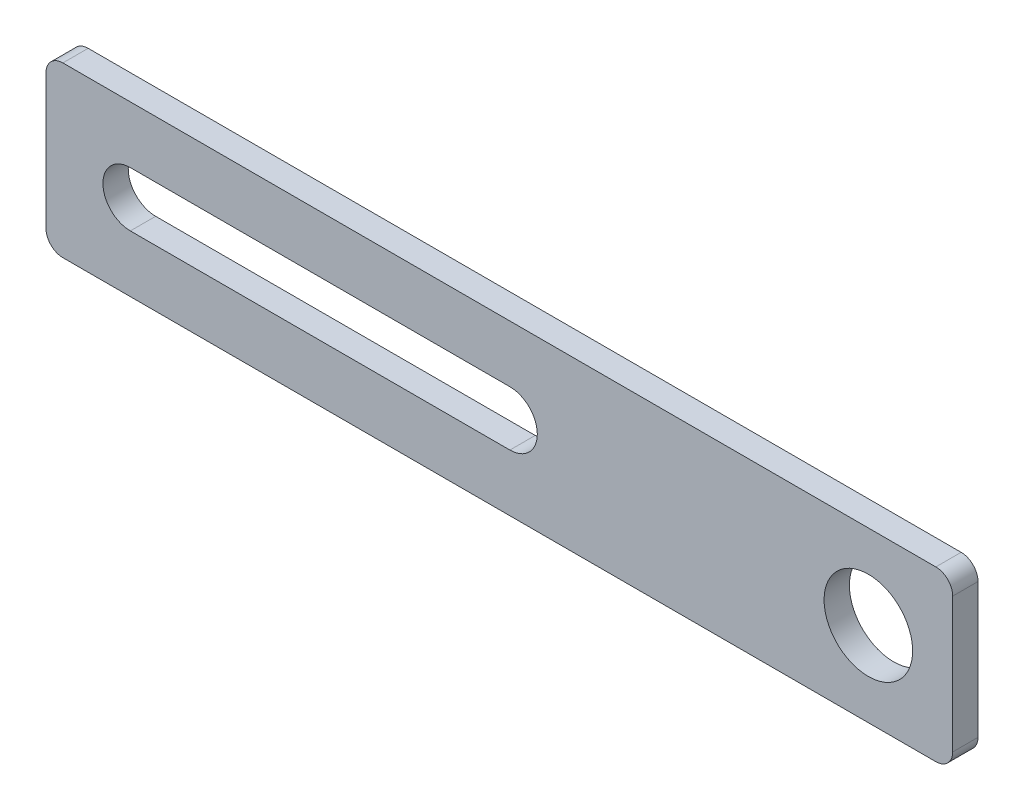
ISO-10303-21;
HEADER;
FILE_DESCRIPTION(('STEP AP214'),'2;1');
FILE_NAME('part.step','',(''),(''),'','','');
FILE_SCHEMA(('AUTOMOTIVE_DESIGN { 1 0 10303 214 1 1 1 1 }'));
ENDSEC;
DATA;
#1=APPLICATION_CONTEXT('core data for automotive mechanical design processes');
#2=APPLICATION_PROTOCOL_DEFINITION('international standard','automotive_design',2000,#1);
#3=PRODUCT_CONTEXT('',#1,'mechanical');
#4=PRODUCT('Part','Part','',(#3));
#5=PRODUCT_RELATED_PRODUCT_CATEGORY('part','',(#4));
#6=PRODUCT_DEFINITION_FORMATION('','',#4);
#7=PRODUCT_DEFINITION_CONTEXT('part definition',#1,'design');
#8=PRODUCT_DEFINITION('design','',#6,#7);
#9=PRODUCT_DEFINITION_SHAPE('','',#8);
#10=(LENGTH_UNIT() NAMED_UNIT(*) SI_UNIT(.MILLI.,.METRE.));
#11=(NAMED_UNIT(*) PLANE_ANGLE_UNIT() SI_UNIT($,.RADIAN.));
#12=(NAMED_UNIT(*) SI_UNIT($,.STERADIAN.) SOLID_ANGLE_UNIT());
#13=UNCERTAINTY_MEASURE_WITH_UNIT(LENGTH_MEASURE(1.E-05),#10,'distance_accuracy_value','');
#14=(GEOMETRIC_REPRESENTATION_CONTEXT(3) GLOBAL_UNCERTAINTY_ASSIGNED_CONTEXT((#13)) GLOBAL_UNIT_ASSIGNED_CONTEXT((#10,
#11,#12)) REPRESENTATION_CONTEXT('',''));
#15=CARTESIAN_POINT('',(0.,0.,0.));
#16=DIRECTION('',(0.,0.,1.));
#17=DIRECTION('',(1.,0.,0.));
#18=AXIS2_PLACEMENT_3D('',#15,#16,#17);
#19=CARTESIAN_POINT('',(105.,-20.,6.));
#20=DIRECTION('',(0.,0.,-1.));
#21=DIRECTION('',(0.,-1.,0.));
#22=AXIS2_PLACEMENT_3D('',#19,#20,#21);
#23=PLANE('',#22);
#24=DIRECTION('',(-1.,0.,0.));
#25=VECTOR('',#24,1.);
#26=CARTESIAN_POINT('',(105.,-20.,6.));
#27=LINE('',#26,#25);
#28=CARTESIAN_POINT('',(101.,-20.,6.));
#29=VERTEX_POINT('',#28);
#30=CARTESIAN_POINT('',(-106.,-20.,6.));
#31=VERTEX_POINT('',#30);
#32=EDGE_CURVE('E157',#29,#31,#27,.T.);
#33=ORIENTED_EDGE('',*,*,#32,.F.);
#34=CARTESIAN_POINT('',(101.,-16.,6.));
#35=DIRECTION('',(0.,0.,-1.));
#36=DIRECTION('',(0.,-1.,0.));
#37=AXIS2_PLACEMENT_3D('',#34,#35,#36);
#38=CIRCLE('',#37,4.);
#39=CARTESIAN_POINT('',(105.,-16.,6.));
#40=VERTEX_POINT('',#39);
#41=EDGE_CURVE('E194',#29,#40,#38,.F.);
#42=ORIENTED_EDGE('',*,*,#41,.T.);
#43=DIRECTION('',(0.,1.,0.));
#44=VECTOR('',#43,1.);
#45=CARTESIAN_POINT('',(105.,-20.,6.));
#46=LINE('',#45,#44);
#47=CARTESIAN_POINT('',(105.,16.,6.));
#48=VERTEX_POINT('',#47);
#49=EDGE_CURVE('E169',#40,#48,#46,.T.);
#50=ORIENTED_EDGE('',*,*,#49,.T.);
#51=CARTESIAN_POINT('',(101.,16.,6.));
#52=DIRECTION('',(0.,0.,-1.));
#53=DIRECTION('',(0.,-1.,0.));
#54=AXIS2_PLACEMENT_3D('',#51,#52,#53);
#55=CIRCLE('',#54,4.);
#56=CARTESIAN_POINT('',(101.,20.,6.));
#57=VERTEX_POINT('',#56);
#58=EDGE_CURVE('E33',#48,#57,#55,.F.);
#59=ORIENTED_EDGE('',*,*,#58,.T.);
#60=DIRECTION('',(-1.,0.,0.));
#61=VECTOR('',#60,1.);
#62=CARTESIAN_POINT('',(105.,20.,6.));
#63=LINE('',#62,#61);
#64=CARTESIAN_POINT('',(-106.,20.,6.));
#65=VERTEX_POINT('',#64);
#66=EDGE_CURVE('E152',#57,#65,#63,.T.);
#67=ORIENTED_EDGE('',*,*,#66,.T.);
#68=CARTESIAN_POINT('',(-106.,16.,6.));
#69=DIRECTION('',(0.,0.,-1.));
#70=DIRECTION('',(0.,-1.,0.));
#71=AXIS2_PLACEMENT_3D('',#68,#69,#70);
#72=CIRCLE('',#71,4.);
#73=CARTESIAN_POINT('',(-110.,16.,6.));
#74=VERTEX_POINT('',#73);
#75=EDGE_CURVE('E190',#65,#74,#72,.F.);
#76=ORIENTED_EDGE('',*,*,#75,.T.);
#77=DIRECTION('',(0.,1.,0.));
#78=VECTOR('',#77,1.);
#79=CARTESIAN_POINT('',(-110.,-20.,6.));
#80=LINE('',#79,#78);
#81=CARTESIAN_POINT('',(-110.,-16.,6.));
#82=VERTEX_POINT('',#81);
#83=EDGE_CURVE('E166',#82,#74,#80,.T.);
#84=ORIENTED_EDGE('',*,*,#83,.F.);
#85=CARTESIAN_POINT('',(-106.,-16.,6.));
#86=DIRECTION('',(0.,0.,-1.));
#87=DIRECTION('',(0.,-1.,0.));
#88=AXIS2_PLACEMENT_3D('',#85,#86,#87);
#89=CIRCLE('',#88,4.);
#90=EDGE_CURVE('E192',#82,#31,#89,.F.);
#91=ORIENTED_EDGE('',*,*,#90,.T.);
#92=EDGE_LOOP('',(#33,#42,#50,#59,#67,#76,#84,#91));
#93=FACE_BOUND('',#92,.T.);
#94=CARTESIAN_POINT('',(85.,0.,6.));
#95=DIRECTION('',(0.,0.,-1.));
#96=DIRECTION('',(0.,-1.,0.));
#97=AXIS2_PLACEMENT_3D('',#94,#95,#96);
#98=CIRCLE('',#97,10.5);
#99=CARTESIAN_POINT('',(85.,-10.5,6.));
#100=VERTEX_POINT('',#99);
#101=EDGE_CURVE('E147',#100,#100,#98,.T.);
#102=ORIENTED_EDGE('',*,*,#101,.T.);
#103=EDGE_LOOP('',(#102));
#104=FACE_BOUND('',#103,.T.);
#105=CARTESIAN_POINT('',(-90.,0.,6.));
#106=DIRECTION('',(0.,0.,1.));
#107=DIRECTION('',(0.,1.,0.));
#108=AXIS2_PLACEMENT_3D('',#105,#106,#107);
#109=CIRCLE('',#108,6.5);
#110=CARTESIAN_POINT('',(-90.,6.5,6.));
#111=VERTEX_POINT('',#110);
#112=CARTESIAN_POINT('',(-90.,-6.5,6.));
#113=VERTEX_POINT('',#112);
#114=EDGE_CURVE('E108',#111,#113,#109,.T.);
#115=ORIENTED_EDGE('',*,*,#114,.F.);
#116=DIRECTION('',(1.,0.,0.));
#117=VECTOR('',#116,1.);
#118=CARTESIAN_POINT('',(-90.,6.5,6.));
#119=LINE('',#118,#117);
#120=CARTESIAN_POINT('',(0.,6.5,6.));
#121=VERTEX_POINT('',#120);
#122=EDGE_CURVE('E137',#111,#121,#119,.T.);
#123=ORIENTED_EDGE('',*,*,#122,.T.);
#124=CARTESIAN_POINT('',(0.,0.,6.));
#125=DIRECTION('',(0.,0.,-1.));
#126=DIRECTION('',(0.,-1.,0.));
#127=AXIS2_PLACEMENT_3D('',#124,#125,#126);
#128=CIRCLE('',#127,6.5);
#129=CARTESIAN_POINT('',(0.,-6.5,6.));
#130=VERTEX_POINT('',#129);
#131=EDGE_CURVE('E134',#121,#130,#128,.T.);
#132=ORIENTED_EDGE('',*,*,#131,.T.);
#133=DIRECTION('',(1.,0.,0.));
#134=VECTOR('',#133,1.);
#135=CARTESIAN_POINT('',(-90.,-6.5,6.));
#136=LINE('',#135,#134);
#137=EDGE_CURVE('E132',#113,#130,#136,.T.);
#138=ORIENTED_EDGE('',*,*,#137,.F.);
#139=EDGE_LOOP('',(#115,#123,#132,#138));
#140=FACE_BOUND('',#139,.T.);
#141=ADVANCED_FACE('F14',(#93,#104,#140),#23,.F.);
#142=CARTESIAN_POINT('',(105.,-20.,0.));
#143=DIRECTION('',(0.,0.,-1.));
#144=DIRECTION('',(0.,-1.,0.));
#145=AXIS2_PLACEMENT_3D('',#142,#143,#144);
#146=PLANE('',#145);
#147=DIRECTION('',(0.,1.,0.));
#148=VECTOR('',#147,1.);
#149=CARTESIAN_POINT('',(105.,-20.,0.));
#150=LINE('',#149,#148);
#151=CARTESIAN_POINT('',(105.,-16.,0.));
#152=VERTEX_POINT('',#151);
#153=CARTESIAN_POINT('',(105.,16.,0.));
#154=VERTEX_POINT('',#153);
#155=EDGE_CURVE('E160',#152,#154,#150,.T.);
#156=ORIENTED_EDGE('',*,*,#155,.F.);
#157=CARTESIAN_POINT('',(101.,-16.,0.));
#158=DIRECTION('',(0.,0.,-1.));
#159=DIRECTION('',(0.,-1.,0.));
#160=AXIS2_PLACEMENT_3D('',#157,#158,#159);
#161=CIRCLE('',#160,4.);
#162=CARTESIAN_POINT('',(101.,-20.,0.));
#163=VERTEX_POINT('',#162);
#164=EDGE_CURVE('E182',#152,#163,#161,.T.);
#165=ORIENTED_EDGE('',*,*,#164,.T.);
#166=DIRECTION('',(-1.,0.,0.));
#167=VECTOR('',#166,1.);
#168=CARTESIAN_POINT('',(105.,-20.,0.));
#169=LINE('',#168,#167);
#170=CARTESIAN_POINT('',(-106.,-20.,0.));
#171=VERTEX_POINT('',#170);
#172=EDGE_CURVE('E154',#163,#171,#169,.T.);
#173=ORIENTED_EDGE('',*,*,#172,.T.);
#174=CARTESIAN_POINT('',(-106.,-16.,0.));
#175=DIRECTION('',(0.,0.,-1.));
#176=DIRECTION('',(0.,-1.,0.));
#177=AXIS2_PLACEMENT_3D('',#174,#175,#176);
#178=CIRCLE('',#177,4.);
#179=CARTESIAN_POINT('',(-110.,-16.,0.));
#180=VERTEX_POINT('',#179);
#181=EDGE_CURVE('E180',#171,#180,#178,.T.);
#182=ORIENTED_EDGE('',*,*,#181,.T.);
#183=DIRECTION('',(0.,1.,0.));
#184=VECTOR('',#183,1.);
#185=CARTESIAN_POINT('',(-110.,-20.,0.));
#186=LINE('',#185,#184);
#187=CARTESIAN_POINT('',(-110.,16.,0.));
#188=VERTEX_POINT('',#187);
#189=EDGE_CURVE('E163',#180,#188,#186,.T.);
#190=ORIENTED_EDGE('',*,*,#189,.T.);
#191=CARTESIAN_POINT('',(-106.,16.,0.));
#192=DIRECTION('',(0.,0.,-1.));
#193=DIRECTION('',(0.,-1.,0.));
#194=AXIS2_PLACEMENT_3D('',#191,#192,#193);
#195=CIRCLE('',#194,4.);
#196=CARTESIAN_POINT('',(-106.,20.,0.));
#197=VERTEX_POINT('',#196);
#198=EDGE_CURVE('E178',#188,#197,#195,.T.);
#199=ORIENTED_EDGE('',*,*,#198,.T.);
#200=DIRECTION('',(-1.,0.,0.));
#201=VECTOR('',#200,1.);
#202=CARTESIAN_POINT('',(105.,20.,0.));
#203=LINE('',#202,#201);
#204=CARTESIAN_POINT('',(101.,20.,0.));
#205=VERTEX_POINT('',#204);
#206=EDGE_CURVE('E150',#205,#197,#203,.T.);
#207=ORIENTED_EDGE('',*,*,#206,.F.);
#208=CARTESIAN_POINT('',(101.,16.,0.));
#209=DIRECTION('',(0.,0.,-1.));
#210=DIRECTION('',(0.,-1.,0.));
#211=AXIS2_PLACEMENT_3D('',#208,#209,#210);
#212=CIRCLE('',#211,4.);
#213=EDGE_CURVE('E176',#205,#154,#212,.T.);
#214=ORIENTED_EDGE('',*,*,#213,.T.);
#215=EDGE_LOOP('',(#156,#165,#173,#182,#190,#199,#207,#214));
#216=FACE_BOUND('',#215,.T.);
#217=CARTESIAN_POINT('',(85.,0.,0.));
#218=DIRECTION('',(0.,0.,-1.));
#219=DIRECTION('',(0.,-1.,0.));
#220=AXIS2_PLACEMENT_3D('',#217,#218,#219);
#221=CIRCLE('',#220,10.5);
#222=CARTESIAN_POINT('',(85.,-10.5,0.));
#223=VERTEX_POINT('',#222);
#224=EDGE_CURVE('E112',#223,#223,#221,.T.);
#225=ORIENTED_EDGE('',*,*,#224,.F.);
#226=EDGE_LOOP('',(#225));
#227=FACE_BOUND('',#226,.T.);
#228=DIRECTION('',(1.,0.,0.));
#229=VECTOR('',#228,1.);
#230=CARTESIAN_POINT('',(-90.,6.5,0.));
#231=LINE('',#230,#229);
#232=CARTESIAN_POINT('',(-90.,6.5,0.));
#233=VERTEX_POINT('',#232);
#234=CARTESIAN_POINT('',(0.,6.5,0.));
#235=VERTEX_POINT('',#234);
#236=EDGE_CURVE('E126',#233,#235,#231,.T.);
#237=ORIENTED_EDGE('',*,*,#236,.F.);
#238=CARTESIAN_POINT('',(-90.,0.,0.));
#239=DIRECTION('',(0.,0.,1.));
#240=DIRECTION('',(0.,1.,0.));
#241=AXIS2_PLACEMENT_3D('',#238,#239,#240);
#242=CIRCLE('',#241,6.5);
#243=CARTESIAN_POINT('',(-90.,-6.5,0.));
#244=VERTEX_POINT('',#243);
#245=EDGE_CURVE('E105',#233,#244,#242,.T.);
#246=ORIENTED_EDGE('',*,*,#245,.T.);
#247=DIRECTION('',(1.,0.,0.));
#248=VECTOR('',#247,1.);
#249=CARTESIAN_POINT('',(-90.,-6.5,0.));
#250=LINE('',#249,#248);
#251=CARTESIAN_POINT('',(0.,-6.5,0.));
#252=VERTEX_POINT('',#251);
#253=EDGE_CURVE('E116',#244,#252,#250,.T.);
#254=ORIENTED_EDGE('',*,*,#253,.T.);
#255=CARTESIAN_POINT('',(0.,0.,0.));
#256=DIRECTION('',(0.,0.,-1.));
#257=DIRECTION('',(0.,-1.,0.));
#258=AXIS2_PLACEMENT_3D('',#255,#256,#257);
#259=CIRCLE('',#258,6.5);
#260=EDGE_CURVE('E121',#235,#252,#259,.T.);
#261=ORIENTED_EDGE('',*,*,#260,.F.);
#262=EDGE_LOOP('',(#237,#246,#254,#261));
#263=FACE_BOUND('',#262,.T.);
#264=ADVANCED_FACE('F124',(#216,#227,#263),#146,.T.);
#265=CARTESIAN_POINT('',(105.,-20.,6.));
#266=DIRECTION('',(1.,0.,0.));
#267=DIRECTION('',(0.,-1.,0.));
#268=AXIS2_PLACEMENT_3D('',#265,#266,#267);
#269=PLANE('',#268);
#270=ORIENTED_EDGE('',*,*,#49,.F.);
#271=DIRECTION('',(0.,0.,-1.));
#272=VECTOR('',#271,1.);
#273=CARTESIAN_POINT('',(105.,-16.,6.));
#274=LINE('',#273,#272);
#275=EDGE_CURVE('E173',#40,#152,#274,.T.);
#276=ORIENTED_EDGE('',*,*,#275,.T.);
#277=ORIENTED_EDGE('',*,*,#155,.T.);
#278=DIRECTION('',(0.,0.,-1.));
#279=VECTOR('',#278,1.);
#280=CARTESIAN_POINT('',(105.,16.,6.));
#281=LINE('',#280,#279);
#282=EDGE_CURVE('E171',#154,#48,#281,.F.);
#283=ORIENTED_EDGE('',*,*,#282,.T.);
#284=EDGE_LOOP('',(#270,#276,#277,#283));
#285=FACE_BOUND('',#284,.T.);
#286=ADVANCED_FACE('F233',(#285),#269,.T.);
#287=CARTESIAN_POINT('',(-110.,-20.,6.));
#288=DIRECTION('',(1.,0.,0.));
#289=DIRECTION('',(0.,-1.,0.));
#290=AXIS2_PLACEMENT_3D('',#287,#288,#289);
#291=PLANE('',#290);
#292=ORIENTED_EDGE('',*,*,#189,.F.);
#293=DIRECTION('',(0.,0.,-1.));
#294=VECTOR('',#293,1.);
#295=CARTESIAN_POINT('',(-110.,-16.,6.));
#296=LINE('',#295,#294);
#297=EDGE_CURVE('E199',#180,#82,#296,.F.);
#298=ORIENTED_EDGE('',*,*,#297,.T.);
#299=ORIENTED_EDGE('',*,*,#83,.T.);
#300=DIRECTION('',(0.,0.,-1.));
#301=VECTOR('',#300,1.);
#302=CARTESIAN_POINT('',(-110.,16.,6.));
#303=LINE('',#302,#301);
#304=EDGE_CURVE('E196',#74,#188,#303,.T.);
#305=ORIENTED_EDGE('',*,*,#304,.T.);
#306=EDGE_LOOP('',(#292,#298,#299,#305));
#307=FACE_BOUND('',#306,.T.);
#308=ADVANCED_FACE('F214',(#307),#291,.F.);
#309=CARTESIAN_POINT('',(105.,-20.,0.));
#310=DIRECTION('',(0.,1.,0.));
#311=DIRECTION('',(1.,0.,0.));
#312=AXIS2_PLACEMENT_3D('',#309,#310,#311);
#313=PLANE('',#312);
#314=ORIENTED_EDGE('',*,*,#172,.F.);
#315=DIRECTION('',(0.,0.,-1.));
#316=VECTOR('',#315,1.);
#317=CARTESIAN_POINT('',(101.,-20.,6.));
#318=LINE('',#317,#316);
#319=EDGE_CURVE('E187',#163,#29,#318,.F.);
#320=ORIENTED_EDGE('',*,*,#319,.T.);
#321=ORIENTED_EDGE('',*,*,#32,.T.);
#322=DIRECTION('',(0.,0.,-1.));
#323=VECTOR('',#322,1.);
#324=CARTESIAN_POINT('',(-106.,-20.,0.));
#325=LINE('',#324,#323);
#326=EDGE_CURVE('E184',#31,#171,#325,.T.);
#327=ORIENTED_EDGE('',*,*,#326,.T.);
#328=EDGE_LOOP('',(#314,#320,#321,#327));
#329=FACE_BOUND('',#328,.T.);
#330=ADVANCED_FACE('F225',(#329),#313,.F.);
#331=CARTESIAN_POINT('',(105.,20.,0.));
#332=DIRECTION('',(0.,1.,0.));
#333=DIRECTION('',(1.,0.,0.));
#334=AXIS2_PLACEMENT_3D('',#331,#332,#333);
#335=PLANE('',#334);
#336=ORIENTED_EDGE('',*,*,#206,.T.);
#337=DIRECTION('',(0.,0.,-1.));
#338=VECTOR('',#337,1.);
#339=CARTESIAN_POINT('',(-106.,20.,6.));
#340=LINE('',#339,#338);
#341=EDGE_CURVE('E9',#197,#65,#340,.F.);
#342=ORIENTED_EDGE('',*,*,#341,.T.);
#343=ORIENTED_EDGE('',*,*,#66,.F.);
#344=DIRECTION('',(0.,0.,-1.));
#345=VECTOR('',#344,1.);
#346=CARTESIAN_POINT('',(101.,20.,0.));
#347=LINE('',#346,#345);
#348=EDGE_CURVE('E21',#57,#205,#347,.T.);
#349=ORIENTED_EDGE('',*,*,#348,.T.);
#350=EDGE_LOOP('',(#336,#342,#343,#349));
#351=FACE_BOUND('',#350,.T.);
#352=ADVANCED_FACE('F203',(#351),#335,.T.);
#353=CARTESIAN_POINT('',(85.,0.,6.));
#354=DIRECTION('',(0.,0.,-1.));
#355=DIRECTION('',(0.,-1.,0.));
#356=AXIS2_PLACEMENT_3D('',#353,#354,#355);
#357=CYLINDRICAL_SURFACE('',#356,10.5);
#358=ORIENTED_EDGE('',*,*,#101,.F.);
#359=EDGE_LOOP('',(#358));
#360=FACE_BOUND('',#359,.T.);
#361=ORIENTED_EDGE('',*,*,#224,.T.);
#362=EDGE_LOOP('',(#361));
#363=FACE_BOUND('',#362,.T.);
#364=ADVANCED_FACE('F265',(#360,#363),#357,.F.);
#365=CARTESIAN_POINT('',(-90.,0.,6.));
#366=DIRECTION('',(0.,0.,-1.));
#367=DIRECTION('',(0.,-1.,0.));
#368=AXIS2_PLACEMENT_3D('',#365,#366,#367);
#369=CYLINDRICAL_SURFACE('',#368,6.5);
#370=DIRECTION('',(0.,0.,-1.));
#371=VECTOR('',#370,1.);
#372=CARTESIAN_POINT('',(-90.,-6.5,6.));
#373=LINE('',#372,#371);
#374=EDGE_CURVE('E101',#113,#244,#373,.T.);
#375=ORIENTED_EDGE('',*,*,#374,.T.);
#376=ORIENTED_EDGE('',*,*,#245,.F.);
#377=DIRECTION('',(0.,0.,-1.));
#378=VECTOR('',#377,1.);
#379=CARTESIAN_POINT('',(-90.,6.5,6.));
#380=LINE('',#379,#378);
#381=EDGE_CURVE('E140',#111,#233,#380,.T.);
#382=ORIENTED_EDGE('',*,*,#381,.F.);
#383=ORIENTED_EDGE('',*,*,#114,.T.);
#384=EDGE_LOOP('',(#375,#376,#382,#383));
#385=FACE_BOUND('',#384,.T.);
#386=ADVANCED_FACE('F103',(#385),#369,.F.);
#387=CARTESIAN_POINT('',(-90.,-6.5,6.));
#388=DIRECTION('',(0.,1.,0.));
#389=DIRECTION('',(1.,0.,0.));
#390=AXIS2_PLACEMENT_3D('',#387,#388,#389);
#391=PLANE('',#390);
#392=DIRECTION('',(0.,0.,-1.));
#393=VECTOR('',#392,1.);
#394=CARTESIAN_POINT('',(0.,-6.5,6.));
#395=LINE('',#394,#393);
#396=EDGE_CURVE('E113',#130,#252,#395,.T.);
#397=ORIENTED_EDGE('',*,*,#396,.T.);
#398=ORIENTED_EDGE('',*,*,#253,.F.);
#399=ORIENTED_EDGE('',*,*,#374,.F.);
#400=ORIENTED_EDGE('',*,*,#137,.T.);
#401=EDGE_LOOP('',(#397,#398,#399,#400));
#402=FACE_BOUND('',#401,.T.);
#403=ADVANCED_FACE('F117',(#402),#391,.T.);
#404=CARTESIAN_POINT('',(0.,0.,6.));
#405=DIRECTION('',(0.,0.,-1.));
#406=DIRECTION('',(0.,-1.,0.));
#407=AXIS2_PLACEMENT_3D('',#404,#405,#406);
#408=CYLINDRICAL_SURFACE('',#407,6.5);
#409=DIRECTION('',(0.,0.,-1.));
#410=VECTOR('',#409,1.);
#411=CARTESIAN_POINT('',(0.,6.5,6.));
#412=LINE('',#411,#410);
#413=EDGE_CURVE('E142',#121,#235,#412,.T.);
#414=ORIENTED_EDGE('',*,*,#413,.T.);
#415=ORIENTED_EDGE('',*,*,#260,.T.);
#416=ORIENTED_EDGE('',*,*,#396,.F.);
#417=ORIENTED_EDGE('',*,*,#131,.F.);
#418=EDGE_LOOP('',(#414,#415,#416,#417));
#419=FACE_BOUND('',#418,.T.);
#420=ADVANCED_FACE('F273',(#419),#408,.F.);
#421=CARTESIAN_POINT('',(-90.,6.5,6.));
#422=DIRECTION('',(0.,1.,0.));
#423=DIRECTION('',(1.,0.,0.));
#424=AXIS2_PLACEMENT_3D('',#421,#422,#423);
#425=PLANE('',#424);
#426=ORIENTED_EDGE('',*,*,#122,.F.);
#427=ORIENTED_EDGE('',*,*,#381,.T.);
#428=ORIENTED_EDGE('',*,*,#236,.T.);
#429=ORIENTED_EDGE('',*,*,#413,.F.);
#430=EDGE_LOOP('',(#426,#427,#428,#429));
#431=FACE_BOUND('',#430,.T.);
#432=ADVANCED_FACE('F276',(#431),#425,.F.);
#433=CARTESIAN_POINT('',(101.,-16.,6.));
#434=DIRECTION('',(0.,0.,1.));
#435=DIRECTION('',(0.,1.,0.));
#436=AXIS2_PLACEMENT_3D('',#433,#434,#435);
#437=CYLINDRICAL_SURFACE('',#436,4.);
#438=ORIENTED_EDGE('',*,*,#41,.F.);
#439=ORIENTED_EDGE('',*,*,#319,.F.);
#440=ORIENTED_EDGE('',*,*,#164,.F.);
#441=ORIENTED_EDGE('',*,*,#275,.F.);
#442=EDGE_LOOP('',(#438,#439,#440,#441));
#443=FACE_BOUND('',#442,.T.);
#444=ADVANCED_FACE('F230',(#443),#437,.T.);
#445=CARTESIAN_POINT('',(-106.,-16.,0.));
#446=DIRECTION('',(0.,0.,-1.));
#447=DIRECTION('',(0.,-1.,0.));
#448=AXIS2_PLACEMENT_3D('',#445,#446,#447);
#449=CYLINDRICAL_SURFACE('',#448,4.);
#450=ORIENTED_EDGE('',*,*,#90,.F.);
#451=ORIENTED_EDGE('',*,*,#297,.F.);
#452=ORIENTED_EDGE('',*,*,#181,.F.);
#453=ORIENTED_EDGE('',*,*,#326,.F.);
#454=EDGE_LOOP('',(#450,#451,#452,#453));
#455=FACE_BOUND('',#454,.T.);
#456=ADVANCED_FACE('F222',(#455),#449,.T.);
#457=CARTESIAN_POINT('',(-106.,16.,6.));
#458=DIRECTION('',(0.,0.,1.));
#459=DIRECTION('',(0.,1.,0.));
#460=AXIS2_PLACEMENT_3D('',#457,#458,#459);
#461=CYLINDRICAL_SURFACE('',#460,4.);
#462=ORIENTED_EDGE('',*,*,#75,.F.);
#463=ORIENTED_EDGE('',*,*,#341,.F.);
#464=ORIENTED_EDGE('',*,*,#198,.F.);
#465=ORIENTED_EDGE('',*,*,#304,.F.);
#466=EDGE_LOOP('',(#462,#463,#464,#465));
#467=FACE_BOUND('',#466,.T.);
#468=ADVANCED_FACE('F212',(#467),#461,.T.);
#469=CARTESIAN_POINT('',(101.,16.,0.));
#470=DIRECTION('',(0.,0.,-1.));
#471=DIRECTION('',(0.,-1.,0.));
#472=AXIS2_PLACEMENT_3D('',#469,#470,#471);
#473=CYLINDRICAL_SURFACE('',#472,4.);
#474=ORIENTED_EDGE('',*,*,#58,.F.);
#475=ORIENTED_EDGE('',*,*,#282,.F.);
#476=ORIENTED_EDGE('',*,*,#213,.F.);
#477=ORIENTED_EDGE('',*,*,#348,.F.);
#478=EDGE_LOOP('',(#474,#475,#476,#477));
#479=FACE_BOUND('',#478,.T.);
#480=ADVANCED_FACE('F235',(#479),#473,.T.);
#481=CLOSED_SHELL('',(#141,#264,#286,#308,#330,#352,#364,#386,#403,#420,#432,#444,#456,#468,#480));
#482=MANIFOLD_SOLID_BREP('B1',#481);
#483=ADVANCED_BREP_SHAPE_REPRESENTATION('',(#18,#482),#14);
#484=SHAPE_DEFINITION_REPRESENTATION(#9,#483);
ENDSEC;
END-ISO-10303-21;
